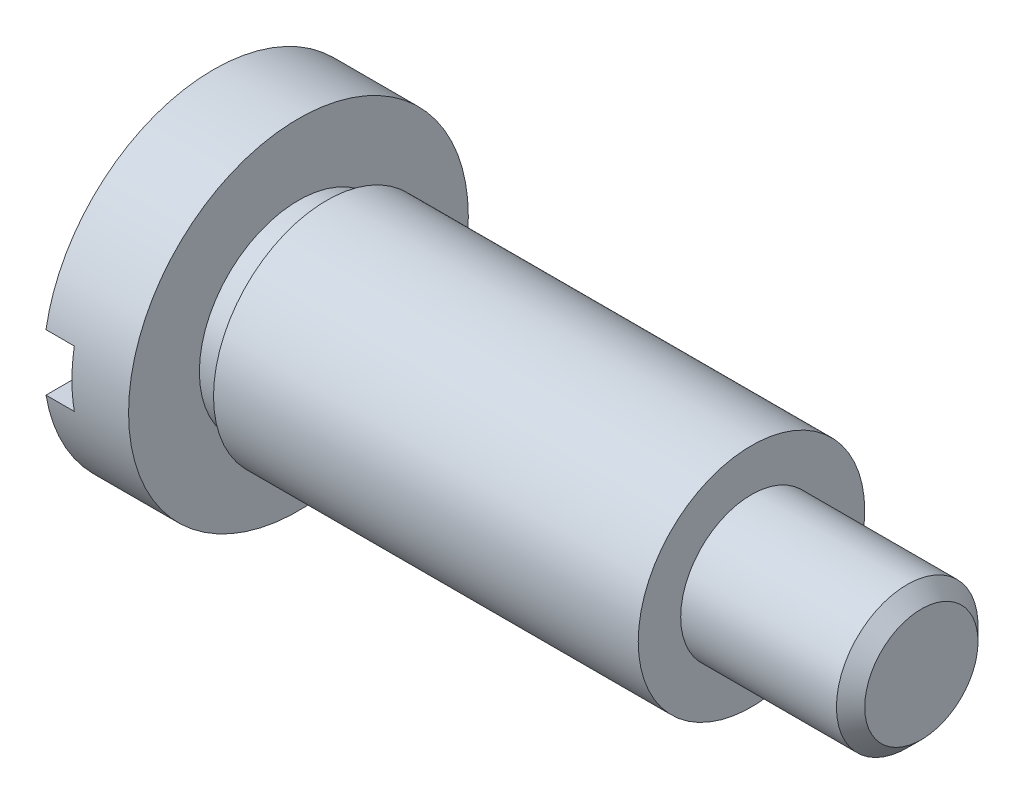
from build123d import *

# Parameters (mm, degrees)
CHANFREIN1_SIZE         = 0.25
ESQUISSE2_W             = 7.486561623
ESQUISSE2_H             = 1
ENL_V_MAT_EXTRU_1_DEPTH = 0.5


with BuildPart() as part:
    # Esquisse1 → R_volution1 (revolve)
    with BuildSketch(Plane.XY, mode=Mode.PRIVATE) as r_volution1_sk:
        Polygon((0, 0), (0, 3), (1.5, 3), (1.5, 2.239897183), (1.5, 1.75), (2, 1.75), (2, 2), (9.5, 2), (9.5, 1.25), (12.5, 1.25), (12.5, 0), align=None)
    revolve(r_volution1_sk.sketch.rotate(Axis((0, 0, 0), (1, 0, 0)), 90), axis=Axis((0, 0, 0), (1, 0, 0)))

    # Chanfrein1
    chanfrein1_edges = [part.edges().sort_by_distance(p)[0] for p in [
        (12.5, 0, -1.25),
    ]]
    chamfer(chanfrein1_edges, length=CHANFREIN1_SIZE)

    # Esquisse2 → Enl_v. mat.-Extru.1 (cut)
    with BuildSketch(Plane.ZY):
        with Locations((0.390803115, 0)):
            Rectangle(ESQUISSE2_W, ESQUISSE2_H)
    extrude(amount=-ENL_V_MAT_EXTRU_1_DEPTH, mode=Mode.SUBTRACT)


solid = part.part
